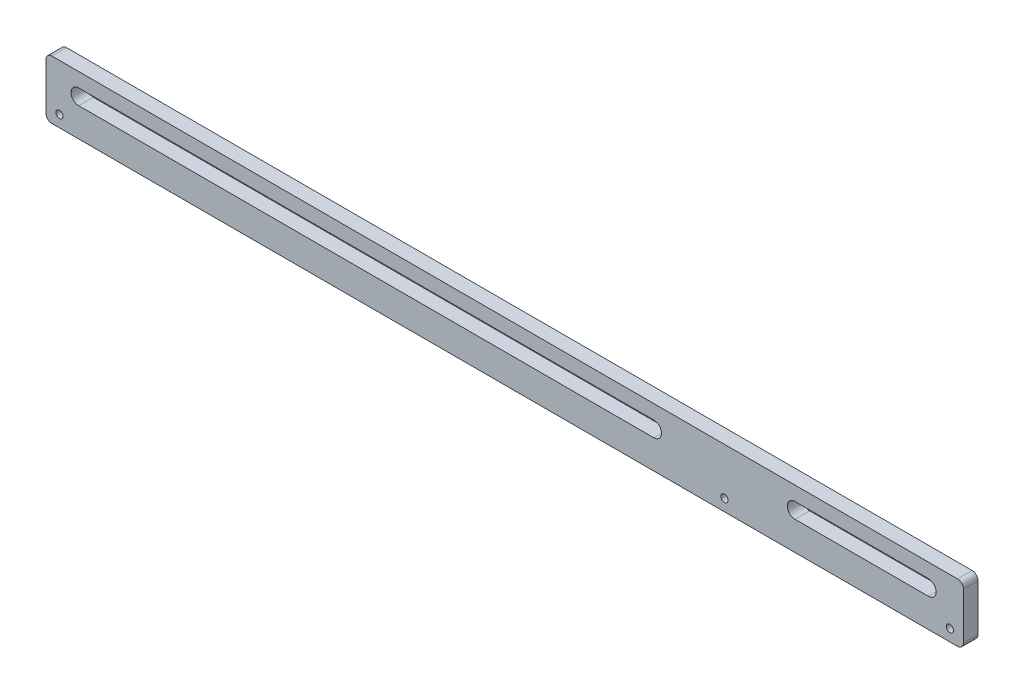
ISO-10303-21;
HEADER;
FILE_DESCRIPTION(('STEP AP214'),'2;1');
FILE_NAME('part.step','',(''),(''),'','','');
FILE_SCHEMA(('AUTOMOTIVE_DESIGN { 1 0 10303 214 1 1 1 1 }'));
ENDSEC;
DATA;
#1=APPLICATION_CONTEXT('core data for automotive mechanical design processes');
#2=APPLICATION_PROTOCOL_DEFINITION('international standard','automotive_design',2000,#1);
#3=PRODUCT_CONTEXT('',#1,'mechanical');
#4=PRODUCT('Part','Part','',(#3));
#5=PRODUCT_RELATED_PRODUCT_CATEGORY('part','',(#4));
#6=PRODUCT_DEFINITION_FORMATION('','',#4);
#7=PRODUCT_DEFINITION_CONTEXT('part definition',#1,'design');
#8=PRODUCT_DEFINITION('design','',#6,#7);
#9=PRODUCT_DEFINITION_SHAPE('','',#8);
#10=(LENGTH_UNIT() NAMED_UNIT(*) SI_UNIT(.MILLI.,.METRE.));
#11=(NAMED_UNIT(*) PLANE_ANGLE_UNIT() SI_UNIT($,.RADIAN.));
#12=(NAMED_UNIT(*) SI_UNIT($,.STERADIAN.) SOLID_ANGLE_UNIT());
#13=UNCERTAINTY_MEASURE_WITH_UNIT(LENGTH_MEASURE(1.E-05),#10,'distance_accuracy_value','');
#14=(GEOMETRIC_REPRESENTATION_CONTEXT(3) GLOBAL_UNCERTAINTY_ASSIGNED_CONTEXT((#13)) GLOBAL_UNIT_ASSIGNED_CONTEXT((#10,
#11,#12)) REPRESENTATION_CONTEXT('',''));
#15=CARTESIAN_POINT('',(0.,0.,0.));
#16=DIRECTION('',(0.,0.,1.));
#17=DIRECTION('',(1.,0.,0.));
#18=AXIS2_PLACEMENT_3D('',#15,#16,#17);
#19=CARTESIAN_POINT('',(0.,0.,6.35));
#20=DIRECTION('',(0.,0.,-1.));
#21=DIRECTION('',(-1.,0.,0.));
#22=AXIS2_PLACEMENT_3D('',#19,#20,#21);
#23=PLANE('',#22);
#24=CARTESIAN_POINT('',(5.86587873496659,5.07999999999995,6.35));
#25=DIRECTION('',(0.,0.,1.));
#26=DIRECTION('',(1.,0.,0.));
#27=AXIS2_PLACEMENT_3D('',#24,#25,#26);
#28=CIRCLE('',#27,1.575);
#29=CARTESIAN_POINT('',(7.44087873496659,5.07999999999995,6.35));
#30=VERTEX_POINT('',#29);
#31=EDGE_CURVE('E473',#30,#30,#28,.T.);
#32=ORIENTED_EDGE('',*,*,#31,.F.);
#33=EDGE_LOOP('',(#32));
#34=FACE_BOUND('',#33,.T.);
#35=CARTESIAN_POINT('',(392.914121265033,5.08000000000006,6.35));
#36=DIRECTION('',(0.,0.,1.));
#37=DIRECTION('',(1.,0.,0.));
#38=AXIS2_PLACEMENT_3D('',#35,#36,#37);
#39=CIRCLE('',#38,1.57500000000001);
#40=CARTESIAN_POINT('',(394.489121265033,5.08000000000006,6.35));
#41=VERTEX_POINT('',#40);
#42=EDGE_CURVE('E475',#41,#41,#39,.T.);
#43=ORIENTED_EDGE('',*,*,#42,.F.);
#44=EDGE_LOOP('',(#43));
#45=FACE_BOUND('',#44,.T.);
#46=CARTESIAN_POINT('',(294.959789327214,5.07999999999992,6.35));
#47=DIRECTION('',(0.,0.,1.));
#48=DIRECTION('',(1.,0.,0.));
#49=AXIS2_PLACEMENT_3D('',#46,#47,#48);
#50=CIRCLE('',#49,1.57500000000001);
#51=CARTESIAN_POINT('',(296.534789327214,5.07999999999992,6.35));
#52=VERTEX_POINT('',#51);
#53=EDGE_CURVE('E481',#52,#52,#50,.T.);
#54=ORIENTED_EDGE('',*,*,#53,.F.);
#55=EDGE_LOOP('',(#54));
#56=FACE_BOUND('',#55,.T.);
#57=CARTESIAN_POINT('',(14.224,15.875,6.35));
#58=DIRECTION('',(0.,0.,1.));
#59=DIRECTION('',(1.,0.,0.));
#60=AXIS2_PLACEMENT_3D('',#57,#58,#59);
#61=CIRCLE('',#60,3.34);
#62=CARTESIAN_POINT('',(14.224,19.215,6.35));
#63=VERTEX_POINT('',#62);
#64=CARTESIAN_POINT('',(14.224,12.535,6.35));
#65=VERTEX_POINT('',#64);
#66=EDGE_CURVE('E190',#63,#65,#61,.T.);
#67=ORIENTED_EDGE('',*,*,#66,.F.);
#68=DIRECTION('',(-1.,0.,0.));
#69=VECTOR('',#68,1.);
#70=CARTESIAN_POINT('',(14.224,19.215,6.35));
#71=LINE('',#70,#69);
#72=CARTESIAN_POINT('',(264.224,19.215,6.35));
#73=VERTEX_POINT('',#72);
#74=EDGE_CURVE('E198',#73,#63,#71,.T.);
#75=ORIENTED_EDGE('',*,*,#74,.F.);
#76=CARTESIAN_POINT('',(264.224,15.875,6.35));
#77=DIRECTION('',(0.,0.,1.));
#78=DIRECTION('',(1.,0.,0.));
#79=AXIS2_PLACEMENT_3D('',#76,#77,#78);
#80=CIRCLE('',#79,3.34);
#81=CARTESIAN_POINT('',(264.224,12.535,6.35));
#82=VERTEX_POINT('',#81);
#83=EDGE_CURVE('E195',#82,#73,#80,.T.);
#84=ORIENTED_EDGE('',*,*,#83,.F.);
#85=DIRECTION('',(1.,0.,0.));
#86=VECTOR('',#85,1.);
#87=CARTESIAN_POINT('',(14.224,12.535,6.35));
#88=LINE('',#87,#86);
#89=EDGE_CURVE('E192',#65,#82,#88,.T.);
#90=ORIENTED_EDGE('',*,*,#89,.F.);
#91=EDGE_LOOP('',(#67,#75,#84,#90));
#92=FACE_BOUND('',#91,.T.);
#93=DIRECTION('',(0.,-1.,0.));
#94=VECTOR('',#93,1.);
#95=CARTESIAN_POINT('',(0.,0.,6.35));
#96=LINE('',#95,#94);
#97=CARTESIAN_POINT('',(0.,22.86,6.35));
#98=VERTEX_POINT('',#97);
#99=CARTESIAN_POINT('',(0.,2.54,6.35));
#100=VERTEX_POINT('',#99);
#101=EDGE_CURVE('E221',#98,#100,#96,.T.);
#102=ORIENTED_EDGE('',*,*,#101,.T.);
#103=CARTESIAN_POINT('',(2.54,2.54,6.35));
#104=DIRECTION('',(0.,0.,-1.));
#105=DIRECTION('',(-1.,0.,0.));
#106=AXIS2_PLACEMENT_3D('',#103,#104,#105);
#107=CIRCLE('',#106,2.54);
#108=CARTESIAN_POINT('',(2.54,0.,6.35));
#109=VERTEX_POINT('',#108);
#110=EDGE_CURVE('E264',#100,#109,#107,.F.);
#111=ORIENTED_EDGE('',*,*,#110,.T.);
#112=DIRECTION('',(1.,0.,0.));
#113=VECTOR('',#112,1.);
#114=CARTESIAN_POINT('',(0.,0.,6.35));
#115=LINE('',#114,#113);
#116=CARTESIAN_POINT('',(396.24,0.,6.35));
#117=VERTEX_POINT('',#116);
#118=EDGE_CURVE('E224',#109,#117,#115,.T.);
#119=ORIENTED_EDGE('',*,*,#118,.T.);
#120=CARTESIAN_POINT('',(396.24,2.54,6.35));
#121=DIRECTION('',(0.,0.,-1.));
#122=DIRECTION('',(-1.,0.,0.));
#123=AXIS2_PLACEMENT_3D('',#120,#121,#122);
#124=CIRCLE('',#123,2.54);
#125=CARTESIAN_POINT('',(398.78,2.54,6.35));
#126=VERTEX_POINT('',#125);
#127=EDGE_CURVE('E262',#117,#126,#124,.F.);
#128=ORIENTED_EDGE('',*,*,#127,.T.);
#129=DIRECTION('',(0.,1.,0.));
#130=VECTOR('',#129,1.);
#131=CARTESIAN_POINT('',(398.78,0.,6.35));
#132=LINE('',#131,#130);
#133=CARTESIAN_POINT('',(398.78,22.86,6.35));
#134=VERTEX_POINT('',#133);
#135=EDGE_CURVE('E228',#126,#134,#132,.T.);
#136=ORIENTED_EDGE('',*,*,#135,.T.);
#137=CARTESIAN_POINT('',(396.24,22.86,6.35));
#138=DIRECTION('',(0.,0.,-1.));
#139=DIRECTION('',(-1.,0.,0.));
#140=AXIS2_PLACEMENT_3D('',#137,#138,#139);
#141=CIRCLE('',#140,2.54);
#142=CARTESIAN_POINT('',(396.24,25.4,6.35));
#143=VERTEX_POINT('',#142);
#144=EDGE_CURVE('E53',#134,#143,#141,.F.);
#145=ORIENTED_EDGE('',*,*,#144,.T.);
#146=DIRECTION('',(-1.,0.,0.));
#147=VECTOR('',#146,1.);
#148=CARTESIAN_POINT('',(0.,25.4,6.35));
#149=LINE('',#148,#147);
#150=CARTESIAN_POINT('',(2.54,25.4,6.35));
#151=VERTEX_POINT('',#150);
#152=EDGE_CURVE('E230',#143,#151,#149,.T.);
#153=ORIENTED_EDGE('',*,*,#152,.T.);
#154=CARTESIAN_POINT('',(2.54,22.86,6.35));
#155=DIRECTION('',(0.,0.,-1.));
#156=DIRECTION('',(-1.,0.,0.));
#157=AXIS2_PLACEMENT_3D('',#154,#155,#156);
#158=CIRCLE('',#157,2.54);
#159=EDGE_CURVE('E259',#151,#98,#158,.F.);
#160=ORIENTED_EDGE('',*,*,#159,.T.);
#161=EDGE_LOOP('',(#102,#111,#119,#128,#136,#145,#153,#160));
#162=FACE_BOUND('',#161,.T.);
#163=CARTESIAN_POINT('',(325.58,15.875,6.35));
#164=DIRECTION('',(0.,0.,1.));
#165=DIRECTION('',(1.,0.,0.));
#166=AXIS2_PLACEMENT_3D('',#163,#164,#165);
#167=CIRCLE('',#166,3.340000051);
#168=CARTESIAN_POINT('',(325.58,19.215000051,6.35));
#169=VERTEX_POINT('',#168);
#170=CARTESIAN_POINT('',(325.58,12.534999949,6.35));
#171=VERTEX_POINT('',#170);
#172=EDGE_CURVE('E147',#169,#171,#167,.T.);
#173=ORIENTED_EDGE('',*,*,#172,.F.);
#174=DIRECTION('',(-1.,0.,0.));
#175=VECTOR('',#174,1.);
#176=CARTESIAN_POINT('',(325.58,19.215000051,6.35));
#177=LINE('',#176,#175);
#178=CARTESIAN_POINT('',(383.58,19.215000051,6.35));
#179=VERTEX_POINT('',#178);
#180=EDGE_CURVE('E172',#179,#169,#177,.T.);
#181=ORIENTED_EDGE('',*,*,#180,.F.);
#182=CARTESIAN_POINT('',(383.58,15.875,6.35));
#183=DIRECTION('',(0.,0.,1.));
#184=DIRECTION('',(1.,0.,0.));
#185=AXIS2_PLACEMENT_3D('',#182,#183,#184);
#186=CIRCLE('',#185,3.340000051);
#187=CARTESIAN_POINT('',(383.58,12.534999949,6.35));
#188=VERTEX_POINT('',#187);
#189=EDGE_CURVE('E170',#188,#179,#186,.T.);
#190=ORIENTED_EDGE('',*,*,#189,.F.);
#191=DIRECTION('',(1.,0.,0.));
#192=VECTOR('',#191,1.);
#193=CARTESIAN_POINT('',(325.58,12.534999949,6.35));
#194=LINE('',#193,#192);
#195=EDGE_CURVE('E157',#171,#188,#194,.T.);
#196=ORIENTED_EDGE('',*,*,#195,.F.);
#197=EDGE_LOOP('',(#173,#181,#190,#196));
#198=FACE_BOUND('',#197,.T.);
#199=ADVANCED_FACE('F32',(#34,#45,#56,#92,#162,#198),#23,.F.);
#200=CARTESIAN_POINT('',(0.,0.,0.));
#201=DIRECTION('',(0.,0.,-1.));
#202=DIRECTION('',(-1.,0.,0.));
#203=AXIS2_PLACEMENT_3D('',#200,#201,#202);
#204=PLANE('',#203);
#205=CARTESIAN_POINT('',(5.86587873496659,5.07999999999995,0.));
#206=DIRECTION('',(0.,0.,1.));
#207=DIRECTION('',(1.,0.,0.));
#208=AXIS2_PLACEMENT_3D('',#205,#206,#207);
#209=CIRCLE('',#208,1.575);
#210=CARTESIAN_POINT('',(7.44087873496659,5.07999999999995,0.));
#211=VERTEX_POINT('',#210);
#212=EDGE_CURVE('E471',#211,#211,#209,.T.);
#213=ORIENTED_EDGE('',*,*,#212,.T.);
#214=EDGE_LOOP('',(#213));
#215=FACE_BOUND('',#214,.T.);
#216=CARTESIAN_POINT('',(392.914121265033,5.08000000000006,0.));
#217=DIRECTION('',(0.,0.,1.));
#218=DIRECTION('',(1.,0.,0.));
#219=AXIS2_PLACEMENT_3D('',#216,#217,#218);
#220=CIRCLE('',#219,1.57500000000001);
#221=CARTESIAN_POINT('',(394.489121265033,5.08000000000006,0.));
#222=VERTEX_POINT('',#221);
#223=EDGE_CURVE('E478',#222,#222,#220,.T.);
#224=ORIENTED_EDGE('',*,*,#223,.T.);
#225=EDGE_LOOP('',(#224));
#226=FACE_BOUND('',#225,.T.);
#227=CARTESIAN_POINT('',(294.959789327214,5.07999999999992,0.));
#228=DIRECTION('',(0.,0.,1.));
#229=DIRECTION('',(1.,0.,0.));
#230=AXIS2_PLACEMENT_3D('',#227,#228,#229);
#231=CIRCLE('',#230,1.57500000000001);
#232=CARTESIAN_POINT('',(296.534789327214,5.07999999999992,0.));
#233=VERTEX_POINT('',#232);
#234=EDGE_CURVE('E179',#233,#233,#231,.T.);
#235=ORIENTED_EDGE('',*,*,#234,.T.);
#236=EDGE_LOOP('',(#235));
#237=FACE_BOUND('',#236,.T.);
#238=DIRECTION('',(-1.,0.,0.));
#239=VECTOR('',#238,1.);
#240=CARTESIAN_POINT('',(14.224,19.215,0.));
#241=LINE('',#240,#239);
#242=CARTESIAN_POINT('',(264.224,19.215,0.));
#243=VERTEX_POINT('',#242);
#244=CARTESIAN_POINT('',(14.224,19.215,0.));
#245=VERTEX_POINT('',#244);
#246=EDGE_CURVE('E193',#243,#245,#241,.T.);
#247=ORIENTED_EDGE('',*,*,#246,.T.);
#248=CARTESIAN_POINT('',(14.224,15.875,0.));
#249=DIRECTION('',(0.,0.,1.));
#250=DIRECTION('',(1.,0.,0.));
#251=AXIS2_PLACEMENT_3D('',#248,#249,#250);
#252=CIRCLE('',#251,3.34);
#253=CARTESIAN_POINT('',(14.224,12.535,0.));
#254=VERTEX_POINT('',#253);
#255=EDGE_CURVE('E165',#245,#254,#252,.T.);
#256=ORIENTED_EDGE('',*,*,#255,.T.);
#257=DIRECTION('',(1.,0.,0.));
#258=VECTOR('',#257,1.);
#259=CARTESIAN_POINT('',(14.224,12.535,0.));
#260=LINE('',#259,#258);
#261=CARTESIAN_POINT('',(264.224,12.535,0.));
#262=VERTEX_POINT('',#261);
#263=EDGE_CURVE('E203',#254,#262,#260,.T.);
#264=ORIENTED_EDGE('',*,*,#263,.T.);
#265=CARTESIAN_POINT('',(264.224,15.875,0.));
#266=DIRECTION('',(0.,0.,1.));
#267=DIRECTION('',(1.,0.,0.));
#268=AXIS2_PLACEMENT_3D('',#265,#266,#267);
#269=CIRCLE('',#268,3.34);
#270=EDGE_CURVE('E206',#262,#243,#269,.T.);
#271=ORIENTED_EDGE('',*,*,#270,.T.);
#272=EDGE_LOOP('',(#247,#256,#264,#271));
#273=FACE_BOUND('',#272,.T.);
#274=DIRECTION('',(1.,0.,0.));
#275=VECTOR('',#274,1.);
#276=CARTESIAN_POINT('',(0.,0.,0.));
#277=LINE('',#276,#275);
#278=CARTESIAN_POINT('',(2.54,0.,0.));
#279=VERTEX_POINT('',#278);
#280=CARTESIAN_POINT('',(396.24,0.,0.));
#281=VERTEX_POINT('',#280);
#282=EDGE_CURVE('E235',#279,#281,#277,.T.);
#283=ORIENTED_EDGE('',*,*,#282,.F.);
#284=CARTESIAN_POINT('',(2.54,2.54,0.));
#285=DIRECTION('',(0.,0.,-1.));
#286=DIRECTION('',(-1.,0.,0.));
#287=AXIS2_PLACEMENT_3D('',#284,#285,#286);
#288=CIRCLE('',#287,2.54);
#289=CARTESIAN_POINT('',(0.,2.54,0.));
#290=VERTEX_POINT('',#289);
#291=EDGE_CURVE('E252',#279,#290,#288,.T.);
#292=ORIENTED_EDGE('',*,*,#291,.T.);
#293=DIRECTION('',(0.,-1.,0.));
#294=VECTOR('',#293,1.);
#295=CARTESIAN_POINT('',(0.,0.,0.));
#296=LINE('',#295,#294);
#297=CARTESIAN_POINT('',(0.,22.86,0.));
#298=VERTEX_POINT('',#297);
#299=EDGE_CURVE('E220',#298,#290,#296,.T.);
#300=ORIENTED_EDGE('',*,*,#299,.F.);
#301=CARTESIAN_POINT('',(2.54,22.86,0.));
#302=DIRECTION('',(0.,0.,-1.));
#303=DIRECTION('',(-1.,0.,0.));
#304=AXIS2_PLACEMENT_3D('',#301,#302,#303);
#305=CIRCLE('',#304,2.54);
#306=CARTESIAN_POINT('',(2.54,25.4,0.));
#307=VERTEX_POINT('',#306);
#308=EDGE_CURVE('E246',#298,#307,#305,.T.);
#309=ORIENTED_EDGE('',*,*,#308,.T.);
#310=DIRECTION('',(-1.,0.,0.));
#311=VECTOR('',#310,1.);
#312=CARTESIAN_POINT('',(0.,25.4,0.));
#313=LINE('',#312,#311);
#314=CARTESIAN_POINT('',(396.24,25.4,0.));
#315=VERTEX_POINT('',#314);
#316=EDGE_CURVE('E225',#315,#307,#313,.T.);
#317=ORIENTED_EDGE('',*,*,#316,.F.);
#318=CARTESIAN_POINT('',(396.24,22.86,0.));
#319=DIRECTION('',(0.,0.,-1.));
#320=DIRECTION('',(-1.,0.,0.));
#321=AXIS2_PLACEMENT_3D('',#318,#319,#320);
#322=CIRCLE('',#321,2.54);
#323=CARTESIAN_POINT('',(398.78,22.86,0.));
#324=VERTEX_POINT('',#323);
#325=EDGE_CURVE('E248',#315,#324,#322,.T.);
#326=ORIENTED_EDGE('',*,*,#325,.T.);
#327=DIRECTION('',(0.,1.,0.));
#328=VECTOR('',#327,1.);
#329=CARTESIAN_POINT('',(398.78,0.,0.));
#330=LINE('',#329,#328);
#331=CARTESIAN_POINT('',(398.78,2.54,0.));
#332=VERTEX_POINT('',#331);
#333=EDGE_CURVE('E238',#332,#324,#330,.T.);
#334=ORIENTED_EDGE('',*,*,#333,.F.);
#335=CARTESIAN_POINT('',(396.24,2.54,0.));
#336=DIRECTION('',(0.,0.,-1.));
#337=DIRECTION('',(-1.,0.,0.));
#338=AXIS2_PLACEMENT_3D('',#335,#336,#337);
#339=CIRCLE('',#338,2.54);
#340=EDGE_CURVE('E250',#332,#281,#339,.T.);
#341=ORIENTED_EDGE('',*,*,#340,.T.);
#342=EDGE_LOOP('',(#283,#292,#300,#309,#317,#326,#334,#341));
#343=FACE_BOUND('',#342,.T.);
#344=DIRECTION('',(-1.,0.,0.));
#345=VECTOR('',#344,1.);
#346=CARTESIAN_POINT('',(325.58,19.215000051,0.));
#347=LINE('',#346,#345);
#348=CARTESIAN_POINT('',(383.58,19.215000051,0.));
#349=VERTEX_POINT('',#348);
#350=CARTESIAN_POINT('',(325.58,19.215000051,0.));
#351=VERTEX_POINT('',#350);
#352=EDGE_CURVE('E158',#349,#351,#347,.T.);
#353=ORIENTED_EDGE('',*,*,#352,.T.);
#354=CARTESIAN_POINT('',(325.58,15.875,0.));
#355=DIRECTION('',(0.,0.,1.));
#356=DIRECTION('',(1.,0.,0.));
#357=AXIS2_PLACEMENT_3D('',#354,#355,#356);
#358=CIRCLE('',#357,3.340000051);
#359=CARTESIAN_POINT('',(325.58,12.534999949,0.));
#360=VERTEX_POINT('',#359);
#361=EDGE_CURVE('E177',#351,#360,#358,.T.);
#362=ORIENTED_EDGE('',*,*,#361,.T.);
#363=DIRECTION('',(1.,0.,0.));
#364=VECTOR('',#363,1.);
#365=CARTESIAN_POINT('',(325.58,12.534999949,0.));
#366=LINE('',#365,#364);
#367=CARTESIAN_POINT('',(383.58,12.534999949,0.));
#368=VERTEX_POINT('',#367);
#369=EDGE_CURVE('E164',#360,#368,#366,.T.);
#370=ORIENTED_EDGE('',*,*,#369,.T.);
#371=CARTESIAN_POINT('',(383.58,15.875,0.));
#372=DIRECTION('',(0.,0.,1.));
#373=DIRECTION('',(1.,0.,0.));
#374=AXIS2_PLACEMENT_3D('',#371,#372,#373);
#375=CIRCLE('',#374,3.340000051);
#376=EDGE_CURVE('E181',#368,#349,#375,.T.);
#377=ORIENTED_EDGE('',*,*,#376,.T.);
#378=EDGE_LOOP('',(#353,#362,#370,#377));
#379=FACE_BOUND('',#378,.T.);
#380=ADVANCED_FACE('F280',(#215,#226,#237,#273,#343,#379),#204,.T.);
#381=CARTESIAN_POINT('',(0.,0.,6.35));
#382=DIRECTION('',(1.,0.,0.));
#383=DIRECTION('',(0.,0.,-1.));
#384=AXIS2_PLACEMENT_3D('',#381,#382,#383);
#385=PLANE('',#384);
#386=ORIENTED_EDGE('',*,*,#299,.T.);
#387=DIRECTION('',(0.,0.,-1.));
#388=VECTOR('',#387,1.);
#389=CARTESIAN_POINT('',(0.,2.54,6.35));
#390=LINE('',#389,#388);
#391=EDGE_CURVE('E257',#290,#100,#390,.F.);
#392=ORIENTED_EDGE('',*,*,#391,.T.);
#393=ORIENTED_EDGE('',*,*,#101,.F.);
#394=DIRECTION('',(0.,0.,-1.));
#395=VECTOR('',#394,1.);
#396=CARTESIAN_POINT('',(0.,22.86,6.35));
#397=LINE('',#396,#395);
#398=EDGE_CURVE('E254',#98,#298,#397,.T.);
#399=ORIENTED_EDGE('',*,*,#398,.T.);
#400=EDGE_LOOP('',(#386,#392,#393,#399));
#401=FACE_BOUND('',#400,.T.);
#402=ADVANCED_FACE('F293',(#401),#385,.F.);
#403=CARTESIAN_POINT('',(0.,0.,6.35));
#404=DIRECTION('',(0.,1.,0.));
#405=DIRECTION('',(0.,0.,1.));
#406=AXIS2_PLACEMENT_3D('',#403,#404,#405);
#407=PLANE('',#406);
#408=ORIENTED_EDGE('',*,*,#118,.F.);
#409=DIRECTION('',(0.,0.,-1.));
#410=VECTOR('',#409,1.);
#411=CARTESIAN_POINT('',(2.54,0.,6.35));
#412=LINE('',#411,#410);
#413=EDGE_CURVE('E243',#109,#279,#412,.T.);
#414=ORIENTED_EDGE('',*,*,#413,.T.);
#415=ORIENTED_EDGE('',*,*,#282,.T.);
#416=DIRECTION('',(0.,0.,-1.));
#417=VECTOR('',#416,1.);
#418=CARTESIAN_POINT('',(396.24,0.,6.35));
#419=LINE('',#418,#417);
#420=EDGE_CURVE('E232',#281,#117,#419,.F.);
#421=ORIENTED_EDGE('',*,*,#420,.T.);
#422=EDGE_LOOP('',(#408,#414,#415,#421));
#423=FACE_BOUND('',#422,.T.);
#424=ADVANCED_FACE('F301',(#423),#407,.F.);
#425=CARTESIAN_POINT('',(398.78,0.,6.35));
#426=DIRECTION('',(-1.,0.,0.));
#427=DIRECTION('',(0.,0.,1.));
#428=AXIS2_PLACEMENT_3D('',#425,#426,#427);
#429=PLANE('',#428);
#430=ORIENTED_EDGE('',*,*,#135,.F.);
#431=DIRECTION('',(0.,0.,-1.));
#432=VECTOR('',#431,1.);
#433=CARTESIAN_POINT('',(398.78,2.54,6.35));
#434=LINE('',#433,#432);
#435=EDGE_CURVE('E268',#126,#332,#434,.T.);
#436=ORIENTED_EDGE('',*,*,#435,.T.);
#437=ORIENTED_EDGE('',*,*,#333,.T.);
#438=DIRECTION('',(0.,0.,-1.));
#439=VECTOR('',#438,1.);
#440=CARTESIAN_POINT('',(398.78,22.86,6.35));
#441=LINE('',#440,#439);
#442=EDGE_CURVE('E266',#324,#134,#441,.F.);
#443=ORIENTED_EDGE('',*,*,#442,.T.);
#444=EDGE_LOOP('',(#430,#436,#437,#443));
#445=FACE_BOUND('',#444,.T.);
#446=ADVANCED_FACE('F274',(#445),#429,.F.);
#447=CARTESIAN_POINT('',(0.,25.4,6.35));
#448=DIRECTION('',(0.,-1.,0.));
#449=DIRECTION('',(0.,0.,-1.));
#450=AXIS2_PLACEMENT_3D('',#447,#448,#449);
#451=PLANE('',#450);
#452=ORIENTED_EDGE('',*,*,#152,.F.);
#453=DIRECTION('',(0.,0.,-1.));
#454=VECTOR('',#453,1.);
#455=CARTESIAN_POINT('',(396.24,25.4,6.35));
#456=LINE('',#455,#454);
#457=EDGE_CURVE('E11',#143,#315,#456,.T.);
#458=ORIENTED_EDGE('',*,*,#457,.T.);
#459=ORIENTED_EDGE('',*,*,#316,.T.);
#460=DIRECTION('',(0.,0.,-1.));
#461=VECTOR('',#460,1.);
#462=CARTESIAN_POINT('',(2.54,25.4,6.35));
#463=LINE('',#462,#461);
#464=EDGE_CURVE('E40',#307,#151,#463,.F.);
#465=ORIENTED_EDGE('',*,*,#464,.T.);
#466=EDGE_LOOP('',(#452,#458,#459,#465));
#467=FACE_BOUND('',#466,.T.);
#468=ADVANCED_FACE('F286',(#467),#451,.F.);
#469=CARTESIAN_POINT('',(14.224,15.875,6.35));
#470=DIRECTION('',(0.,0.,-1.));
#471=DIRECTION('',(-1.,0.,0.));
#472=AXIS2_PLACEMENT_3D('',#469,#470,#471);
#473=CYLINDRICAL_SURFACE('',#472,3.34);
#474=ORIENTED_EDGE('',*,*,#255,.F.);
#475=DIRECTION('',(0.,0.,-1.));
#476=VECTOR('',#475,1.);
#477=CARTESIAN_POINT('',(14.224,19.215,6.35));
#478=LINE('',#477,#476);
#479=EDGE_CURVE('E200',#63,#245,#478,.T.);
#480=ORIENTED_EDGE('',*,*,#479,.F.);
#481=ORIENTED_EDGE('',*,*,#66,.T.);
#482=DIRECTION('',(0.,0.,-1.));
#483=VECTOR('',#482,1.);
#484=CARTESIAN_POINT('',(14.224,12.535,6.35));
#485=LINE('',#484,#483);
#486=EDGE_CURVE('E217',#65,#254,#485,.T.);
#487=ORIENTED_EDGE('',*,*,#486,.T.);
#488=EDGE_LOOP('',(#474,#480,#481,#487));
#489=FACE_BOUND('',#488,.T.);
#490=ADVANCED_FACE('F323',(#489),#473,.F.);
#491=CARTESIAN_POINT('',(14.224,12.535,6.35));
#492=DIRECTION('',(0.,1.,0.));
#493=DIRECTION('',(0.,0.,1.));
#494=AXIS2_PLACEMENT_3D('',#491,#492,#493);
#495=PLANE('',#494);
#496=ORIENTED_EDGE('',*,*,#263,.F.);
#497=ORIENTED_EDGE('',*,*,#486,.F.);
#498=ORIENTED_EDGE('',*,*,#89,.T.);
#499=DIRECTION('',(0.,0.,-1.));
#500=VECTOR('',#499,1.);
#501=CARTESIAN_POINT('',(264.224,12.535,6.35));
#502=LINE('',#501,#500);
#503=EDGE_CURVE('E215',#82,#262,#502,.T.);
#504=ORIENTED_EDGE('',*,*,#503,.T.);
#505=EDGE_LOOP('',(#496,#497,#498,#504));
#506=FACE_BOUND('',#505,.T.);
#507=ADVANCED_FACE('F357',(#506),#495,.T.);
#508=CARTESIAN_POINT('',(264.224,15.875,6.35));
#509=DIRECTION('',(0.,0.,-1.));
#510=DIRECTION('',(-1.,0.,0.));
#511=AXIS2_PLACEMENT_3D('',#508,#509,#510);
#512=CYLINDRICAL_SURFACE('',#511,3.34);
#513=ORIENTED_EDGE('',*,*,#270,.F.);
#514=ORIENTED_EDGE('',*,*,#503,.F.);
#515=ORIENTED_EDGE('',*,*,#83,.T.);
#516=DIRECTION('',(0.,0.,-1.));
#517=VECTOR('',#516,1.);
#518=CARTESIAN_POINT('',(264.224,19.215,6.35));
#519=LINE('',#518,#517);
#520=EDGE_CURVE('E213',#73,#243,#519,.T.);
#521=ORIENTED_EDGE('',*,*,#520,.T.);
#522=EDGE_LOOP('',(#513,#514,#515,#521));
#523=FACE_BOUND('',#522,.T.);
#524=ADVANCED_FACE('F364',(#523),#512,.F.);
#525=CARTESIAN_POINT('',(14.224,19.215,6.35));
#526=DIRECTION('',(0.,-1.,0.));
#527=DIRECTION('',(0.,0.,-1.));
#528=AXIS2_PLACEMENT_3D('',#525,#526,#527);
#529=PLANE('',#528);
#530=ORIENTED_EDGE('',*,*,#246,.F.);
#531=ORIENTED_EDGE('',*,*,#520,.F.);
#532=ORIENTED_EDGE('',*,*,#74,.T.);
#533=ORIENTED_EDGE('',*,*,#479,.T.);
#534=EDGE_LOOP('',(#530,#531,#532,#533));
#535=FACE_BOUND('',#534,.T.);
#536=ADVANCED_FACE('F371',(#535),#529,.T.);
#537=CARTESIAN_POINT('',(325.58,15.875,6.35));
#538=DIRECTION('',(0.,0.,-1.));
#539=DIRECTION('',(-1.,0.,0.));
#540=AXIS2_PLACEMENT_3D('',#537,#538,#539);
#541=CYLINDRICAL_SURFACE('',#540,3.340000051);
#542=ORIENTED_EDGE('',*,*,#361,.F.);
#543=DIRECTION('',(0.,0.,-1.));
#544=VECTOR('',#543,1.);
#545=CARTESIAN_POINT('',(325.58,19.215000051,6.35));
#546=LINE('',#545,#544);
#547=EDGE_CURVE('E153',#169,#351,#546,.T.);
#548=ORIENTED_EDGE('',*,*,#547,.F.);
#549=ORIENTED_EDGE('',*,*,#172,.T.);
#550=DIRECTION('',(0.,0.,-1.));
#551=VECTOR('',#550,1.);
#552=CARTESIAN_POINT('',(325.58,12.534999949,6.35));
#553=LINE('',#552,#551);
#554=EDGE_CURVE('E150',#171,#360,#553,.T.);
#555=ORIENTED_EDGE('',*,*,#554,.T.);
#556=EDGE_LOOP('',(#542,#548,#549,#555));
#557=FACE_BOUND('',#556,.T.);
#558=ADVANCED_FACE('F149',(#557),#541,.F.);
#559=CARTESIAN_POINT('',(325.58,12.534999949,6.35));
#560=DIRECTION('',(0.,1.,0.));
#561=DIRECTION('',(0.,0.,1.));
#562=AXIS2_PLACEMENT_3D('',#559,#560,#561);
#563=PLANE('',#562);
#564=ORIENTED_EDGE('',*,*,#369,.F.);
#565=ORIENTED_EDGE('',*,*,#554,.F.);
#566=ORIENTED_EDGE('',*,*,#195,.T.);
#567=DIRECTION('',(0.,0.,-1.));
#568=VECTOR('',#567,1.);
#569=CARTESIAN_POINT('',(383.58,12.534999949,6.35));
#570=LINE('',#569,#568);
#571=EDGE_CURVE('E166',#188,#368,#570,.T.);
#572=ORIENTED_EDGE('',*,*,#571,.T.);
#573=EDGE_LOOP('',(#564,#565,#566,#572));
#574=FACE_BOUND('',#573,.T.);
#575=ADVANCED_FACE('F161',(#574),#563,.T.);
#576=CARTESIAN_POINT('',(383.58,15.875,6.35));
#577=DIRECTION('',(0.,0.,-1.));
#578=DIRECTION('',(-1.,0.,0.));
#579=AXIS2_PLACEMENT_3D('',#576,#577,#578);
#580=CYLINDRICAL_SURFACE('',#579,3.340000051);
#581=ORIENTED_EDGE('',*,*,#376,.F.);
#582=ORIENTED_EDGE('',*,*,#571,.F.);
#583=ORIENTED_EDGE('',*,*,#189,.T.);
#584=DIRECTION('',(0.,0.,-1.));
#585=VECTOR('',#584,1.);
#586=CARTESIAN_POINT('',(383.58,19.215000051,6.35));
#587=LINE('',#586,#585);
#588=EDGE_CURVE('E187',#179,#349,#587,.T.);
#589=ORIENTED_EDGE('',*,*,#588,.T.);
#590=EDGE_LOOP('',(#581,#582,#583,#589));
#591=FACE_BOUND('',#590,.T.);
#592=ADVANCED_FACE('F392',(#591),#580,.F.);
#593=CARTESIAN_POINT('',(325.58,19.215000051,6.35));
#594=DIRECTION('',(0.,-1.,0.));
#595=DIRECTION('',(0.,0.,-1.));
#596=AXIS2_PLACEMENT_3D('',#593,#594,#595);
#597=PLANE('',#596);
#598=ORIENTED_EDGE('',*,*,#352,.F.);
#599=ORIENTED_EDGE('',*,*,#588,.F.);
#600=ORIENTED_EDGE('',*,*,#180,.T.);
#601=ORIENTED_EDGE('',*,*,#547,.T.);
#602=EDGE_LOOP('',(#598,#599,#600,#601));
#603=FACE_BOUND('',#602,.T.);
#604=ADVANCED_FACE('F310',(#603),#597,.T.);
#605=CARTESIAN_POINT('',(2.54,2.54,6.35));
#606=DIRECTION('',(0.,0.,-1.));
#607=DIRECTION('',(-1.,0.,0.));
#608=AXIS2_PLACEMENT_3D('',#605,#606,#607);
#609=CYLINDRICAL_SURFACE('',#608,2.54);
#610=ORIENTED_EDGE('',*,*,#110,.F.);
#611=ORIENTED_EDGE('',*,*,#391,.F.);
#612=ORIENTED_EDGE('',*,*,#291,.F.);
#613=ORIENTED_EDGE('',*,*,#413,.F.);
#614=EDGE_LOOP('',(#610,#611,#612,#613));
#615=FACE_BOUND('',#614,.T.);
#616=ADVANCED_FACE('F298',(#615),#609,.T.);
#617=CARTESIAN_POINT('',(396.24,2.54,6.35));
#618=DIRECTION('',(0.,0.,-1.));
#619=DIRECTION('',(-1.,0.,0.));
#620=AXIS2_PLACEMENT_3D('',#617,#618,#619);
#621=CYLINDRICAL_SURFACE('',#620,2.54);
#622=ORIENTED_EDGE('',*,*,#127,.F.);
#623=ORIENTED_EDGE('',*,*,#420,.F.);
#624=ORIENTED_EDGE('',*,*,#340,.F.);
#625=ORIENTED_EDGE('',*,*,#435,.F.);
#626=EDGE_LOOP('',(#622,#623,#624,#625));
#627=FACE_BOUND('',#626,.T.);
#628=ADVANCED_FACE('F303',(#627),#621,.T.);
#629=CARTESIAN_POINT('',(396.24,22.86,6.35));
#630=DIRECTION('',(0.,0.,-1.));
#631=DIRECTION('',(-1.,0.,0.));
#632=AXIS2_PLACEMENT_3D('',#629,#630,#631);
#633=CYLINDRICAL_SURFACE('',#632,2.54);
#634=ORIENTED_EDGE('',*,*,#144,.F.);
#635=ORIENTED_EDGE('',*,*,#442,.F.);
#636=ORIENTED_EDGE('',*,*,#325,.F.);
#637=ORIENTED_EDGE('',*,*,#457,.F.);
#638=EDGE_LOOP('',(#634,#635,#636,#637));
#639=FACE_BOUND('',#638,.T.);
#640=ADVANCED_FACE('F285',(#639),#633,.T.);
#641=CARTESIAN_POINT('',(2.54,22.86,6.35));
#642=DIRECTION('',(0.,0.,-1.));
#643=DIRECTION('',(-1.,0.,0.));
#644=AXIS2_PLACEMENT_3D('',#641,#642,#643);
#645=CYLINDRICAL_SURFACE('',#644,2.54);
#646=ORIENTED_EDGE('',*,*,#159,.F.);
#647=ORIENTED_EDGE('',*,*,#464,.F.);
#648=ORIENTED_EDGE('',*,*,#308,.F.);
#649=ORIENTED_EDGE('',*,*,#398,.F.);
#650=EDGE_LOOP('',(#646,#647,#648,#649));
#651=FACE_BOUND('',#650,.T.);
#652=ADVANCED_FACE('F34',(#651),#645,.T.);
#653=CARTESIAN_POINT('',(294.959789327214,5.07999999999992,0.));
#654=DIRECTION('',(0.,0.,1.));
#655=DIRECTION('',(1.,0.,0.));
#656=AXIS2_PLACEMENT_3D('',#653,#654,#655);
#657=CYLINDRICAL_SURFACE('',#656,1.57500000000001);
#658=ORIENTED_EDGE('',*,*,#234,.F.);
#659=EDGE_LOOP('',(#658));
#660=FACE_BOUND('',#659,.T.);
#661=ORIENTED_EDGE('',*,*,#53,.T.);
#662=EDGE_LOOP('',(#661));
#663=FACE_BOUND('',#662,.T.);
#664=ADVANCED_FACE('F427',(#660,#663),#657,.F.);
#665=CARTESIAN_POINT('',(392.914121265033,5.08000000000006,0.));
#666=DIRECTION('',(0.,0.,1.));
#667=DIRECTION('',(1.,0.,0.));
#668=AXIS2_PLACEMENT_3D('',#665,#666,#667);
#669=CYLINDRICAL_SURFACE('',#668,1.57500000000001);
#670=ORIENTED_EDGE('',*,*,#223,.F.);
#671=EDGE_LOOP('',(#670));
#672=FACE_BOUND('',#671,.T.);
#673=ORIENTED_EDGE('',*,*,#42,.T.);
#674=EDGE_LOOP('',(#673));
#675=FACE_BOUND('',#674,.T.);
#676=ADVANCED_FACE('F444',(#672,#675),#669,.F.);
#677=CARTESIAN_POINT('',(5.86587873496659,5.07999999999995,0.));
#678=DIRECTION('',(0.,0.,1.));
#679=DIRECTION('',(1.,0.,0.));
#680=AXIS2_PLACEMENT_3D('',#677,#678,#679);
#681=CYLINDRICAL_SURFACE('',#680,1.575);
#682=ORIENTED_EDGE('',*,*,#212,.F.);
#683=EDGE_LOOP('',(#682));
#684=FACE_BOUND('',#683,.T.);
#685=ORIENTED_EDGE('',*,*,#31,.T.);
#686=EDGE_LOOP('',(#685));
#687=FACE_BOUND('',#686,.T.);
#688=ADVANCED_FACE('F454',(#684,#687),#681,.F.);
#689=CLOSED_SHELL('',(#199,#380,#402,#424,#446,#468,#490,#507,#524,#536,#558,#575,#592,#604,
#616,#628,#640,#652,#664,#676,#688));
#690=MANIFOLD_SOLID_BREP('B2',#689);
#691=ADVANCED_BREP_SHAPE_REPRESENTATION('',(#18,#690),#14);
#692=SHAPE_DEFINITION_REPRESENTATION(#9,#691);
ENDSEC;
END-ISO-10303-21;
